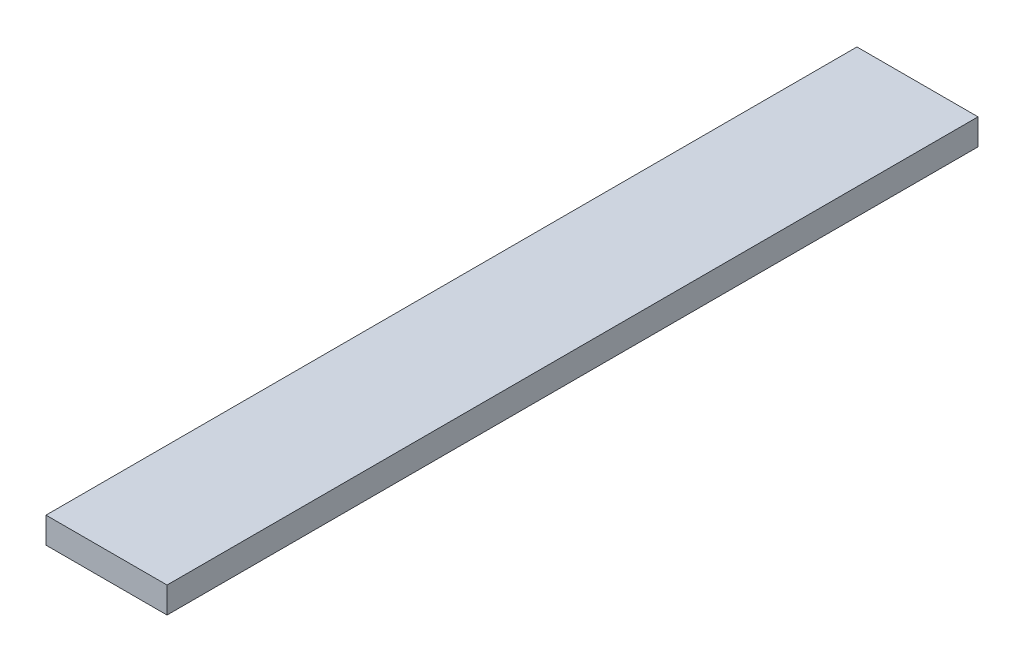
from build123d import *

# Parameters (mm, degrees)
SKETCH1_W           = 590.55
SKETCH1_H           = 3956.14144
BOSS_EXTRUDE1_DEPTH = 127


with BuildPart() as part:
    # Sketch1 → Boss-Extrude1 (new body)
    with BuildSketch(Plane(origin=(0, 0, 0), x_dir=(1, 0, 0), z_dir=(0, 1, 0))):
        Rectangle(SKETCH1_W, SKETCH1_H)
    extrude(amount=BOSS_EXTRUDE1_DEPTH)


solid = part.part
